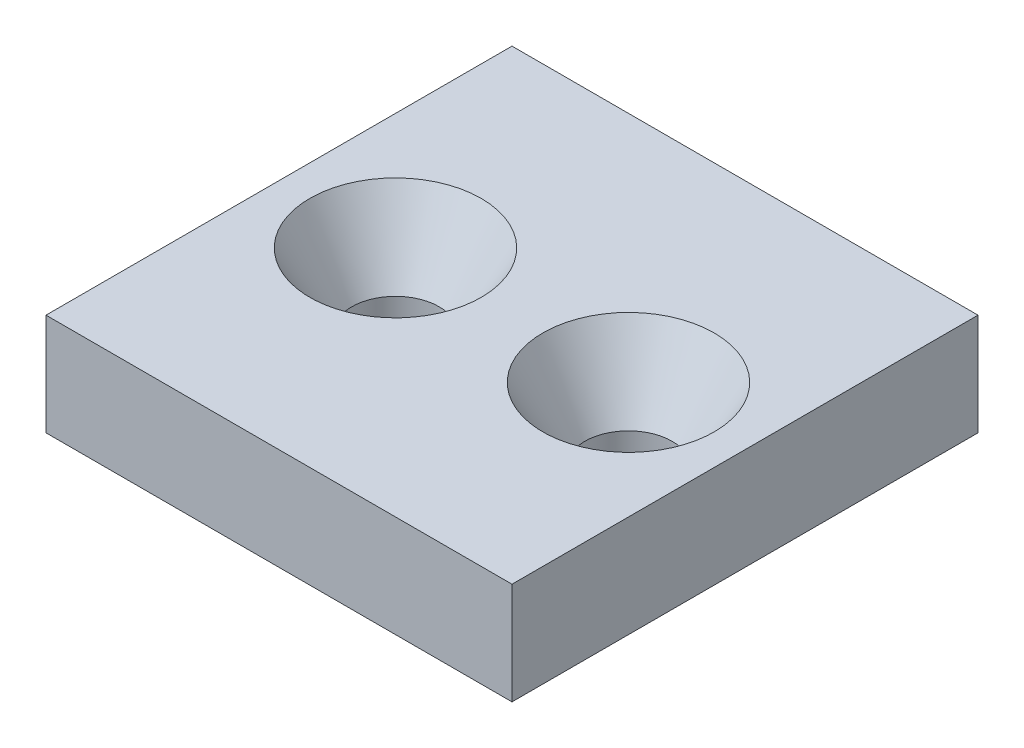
from build123d import *

# Parameters (mm, degrees)
SKETCH2_W      = 32
SKETCH2_H      = 32
EXTRUDE1_DEPTH = 7


with BuildPart() as part:
    # Sketch2 → Extrude1 (new body)
    with BuildSketch(Plane(origin=(0, 0, 0), x_dir=(1, 0, 0), z_dir=(0, 1, 0))):
        Rectangle(SKETCH2_W, SKETCH2_H)
    extrude(amount=EXTRUDE1_DEPTH)

    # Sketch4 → D7 V60 Hole (revolve, cut)
    with BuildSketch(Plane.XY, mode=Mode.PRIVATE) as d7_v60_hole_sk:
        Polygon((-11, 0), (-11, 2), (-13.886751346, 7), (-8, 7), (-8, 0), align=None)
    d7_v60_hole = revolve(d7_v60_hole_sk.sketch.rotate(Axis((-8, 0, 0), (0, 1, 0)), 270), axis=Axis((-8, 0, 0), (0, 1, 0)), mode=Mode.SUBTRACT)

    # Mirror1: D7 V60 Hole across plane
    add(d7_v60_hole.mirror(Plane(origin=(0, 0, 0), x_dir=(0, 0, 1), z_dir=(1, 0, 0))), mode=Mode.SUBTRACT)


solid = part.part
